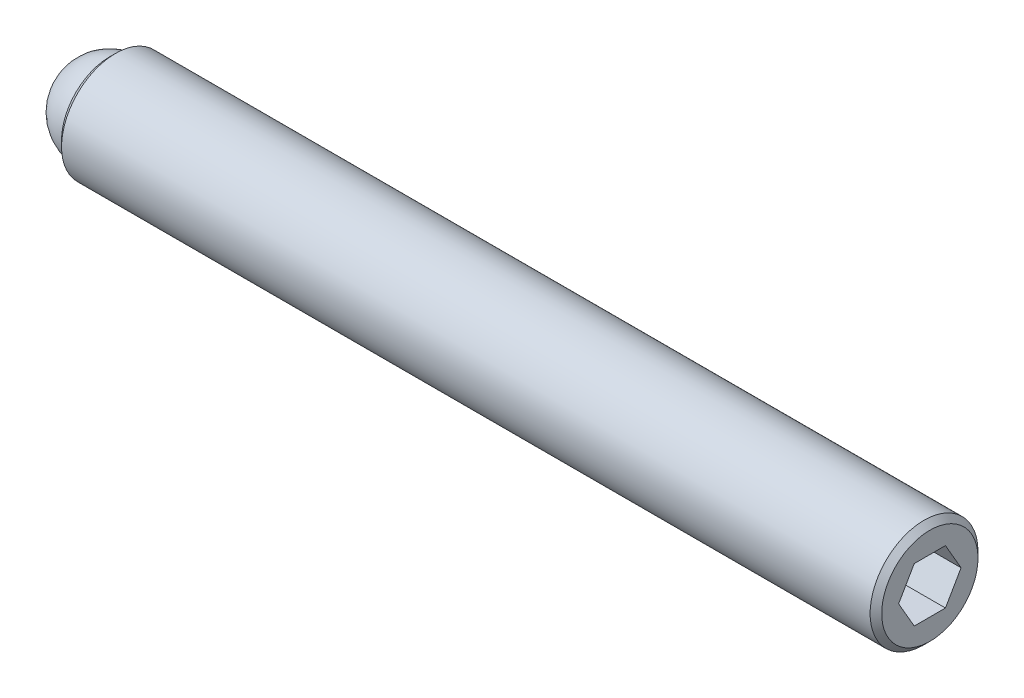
from build123d import *

# Parameters (mm, degrees)
SKETCH2_R           = 2.3749
BOSS_EXTRUDE1_DEPTH = 36.115625
CHAMFER1_SIZE       = 0.254
CHAMFER2_SIZE       = 0.254
CUT_EXTRUDE2_DEPTH  = 2.286
SKETCH3_R           = 1.9812
CUT_EXTRUDE3_DEPTH  = 1.984375


with BuildPart() as part:
    # Sketch2 → Boss-Extrude1 (new body)
    with BuildSketch(Plane(origin=(0, 0, 0), x_dir=(0, 0, -1), z_dir=(1, 0, 0))):
        Circle(SKETCH2_R)
    extrude(amount=BOSS_EXTRUDE1_DEPTH)

    # Chamfer1
    chamfer1_edges = [part.edges().sort_by_distance(p)[0] for p in [
        (0, 0, 2.3749),
    ]]
    chamfer(chamfer1_edges, length=CHAMFER1_SIZE)

    # Chamfer2
    chamfer2_edges = [part.edges().sort_by_distance(p)[0] for p in [
        (36.115625, 0, 2.3749),
    ]]
    chamfer(chamfer2_edges, length=CHAMFER2_SIZE)

    # Sketch4 → Cut-Extrude2 (cut)
    with BuildSketch(Plane(origin=(36.115625, 0, 0), x_dir=(0, 0, -1), z_dir=(1, 0, 0))):
        Polygon((1.374815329, 0), (0.687407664, 1.190625), (-0.687407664, 1.190625), (-1.374815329, 0), (-0.687407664, -1.190625), (0.687407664, -1.190625), align=None)
    extrude(amount=-CUT_EXTRUDE2_DEPTH, mode=Mode.SUBTRACT)

    # Sketch3 → Cut-Extrude3 (cut)
    with BuildSketch(Plane.ZY):
        Circle(SKETCH3_R)
    extrude(amount=-CUT_EXTRUDE3_DEPTH, mode=Mode.SUBTRACT)


with BuildPart() as body_2:
    # Sketch5 → Revolve1 (revolve)
    with BuildSketch(Plane.ZY):
        with BuildLine():
            Line((0, 0), (0, -1.984375))
            ThreePointArc((0, -1.984375), (-1.984375, 0), (0, 1.984375))
            Line((0, 1.984375), (0, 0))
        make_face()
    revolve(axis=Axis((0, 0, 0), (0, 1, 0)))


solid = Compound([part.part, body_2.part])
